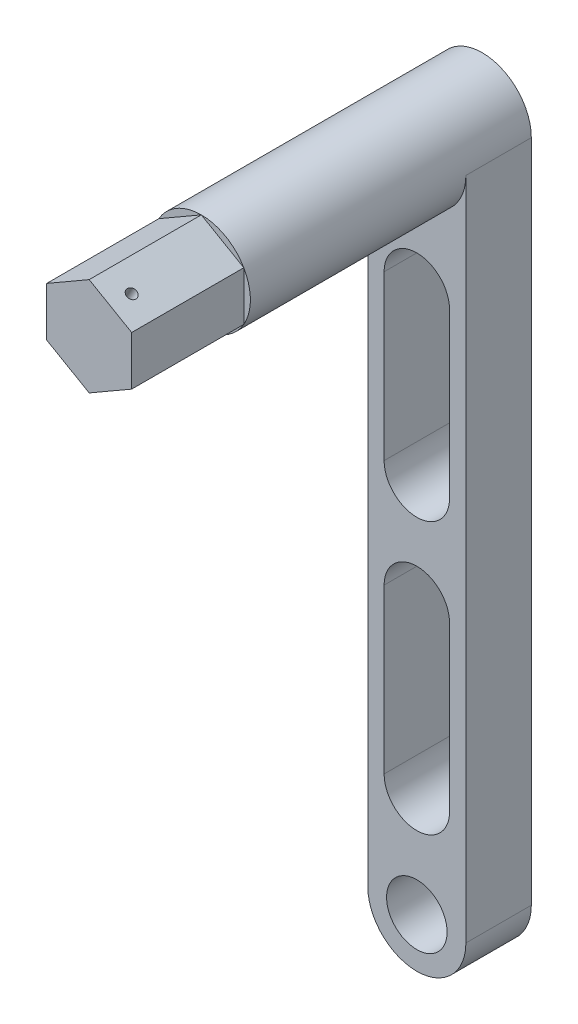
ISO-10303-21;
HEADER;
FILE_DESCRIPTION(('STEP AP214'),'2;1');
FILE_NAME('part.step','',(''),(''),'','','');
FILE_SCHEMA(('AUTOMOTIVE_DESIGN { 1 0 10303 214 1 1 1 1 }'));
ENDSEC;
DATA;
#1=APPLICATION_CONTEXT('core data for automotive mechanical design processes');
#2=APPLICATION_PROTOCOL_DEFINITION('international standard','automotive_design',2000,#1);
#3=PRODUCT_CONTEXT('',#1,'mechanical');
#4=PRODUCT('Part','Part','',(#3));
#5=PRODUCT_RELATED_PRODUCT_CATEGORY('part','',(#4));
#6=PRODUCT_DEFINITION_FORMATION('','',#4);
#7=PRODUCT_DEFINITION_CONTEXT('part definition',#1,'design');
#8=PRODUCT_DEFINITION('design','',#6,#7);
#9=PRODUCT_DEFINITION_SHAPE('','',#8);
#10=(LENGTH_UNIT() NAMED_UNIT(*) SI_UNIT(.MILLI.,.METRE.));
#11=(NAMED_UNIT(*) PLANE_ANGLE_UNIT() SI_UNIT($,.RADIAN.));
#12=(NAMED_UNIT(*) SI_UNIT($,.STERADIAN.) SOLID_ANGLE_UNIT());
#13=UNCERTAINTY_MEASURE_WITH_UNIT(LENGTH_MEASURE(1.E-05),#10,'distance_accuracy_value','');
#14=(GEOMETRIC_REPRESENTATION_CONTEXT(3) GLOBAL_UNCERTAINTY_ASSIGNED_CONTEXT((#13)) GLOBAL_UNIT_ASSIGNED_CONTEXT((#10,
#11,#12)) REPRESENTATION_CONTEXT('',''));
#15=CARTESIAN_POINT('',(0.,0.,0.));
#16=DIRECTION('',(0.,0.,1.));
#17=DIRECTION('',(1.,0.,0.));
#18=AXIS2_PLACEMENT_3D('',#15,#16,#17);
#19=CARTESIAN_POINT('',(0.,0.,42.94));
#20=DIRECTION('',(0.,0.,1.));
#21=DIRECTION('',(1.,0.,0.));
#22=AXIS2_PLACEMENT_3D('',#19,#20,#21);
#23=PLANE('',#22);
#24=DIRECTION('',(0.866025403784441,-0.499999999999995,0.));
#25=VECTOR('',#24,1.);
#26=CARTESIAN_POINT('',(-6.49519052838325,47.0499999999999,42.94));
#27=LINE('',#26,#25);
#28=CARTESIAN_POINT('',(-6.49519052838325,47.0499999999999,42.94));
#29=VERTEX_POINT('',#28);
#30=CARTESIAN_POINT('',(0.,43.3,42.94));
#31=VERTEX_POINT('',#30);
#32=EDGE_CURVE('E61',#29,#31,#27,.T.);
#33=ORIENTED_EDGE('',*,*,#32,.F.);
#34=CARTESIAN_POINT('',(0.,50.8,42.94));
#35=DIRECTION('',(0.,0.,1.));
#36=DIRECTION('',(1.,0.,0.));
#37=AXIS2_PLACEMENT_3D('',#34,#35,#36);
#38=CIRCLE('',#37,7.5);
#39=EDGE_CURVE('E424',#29,#31,#38,.T.);
#40=ORIENTED_EDGE('',*,*,#39,.T.);
#41=EDGE_LOOP('',(#33,#40));
#42=FACE_BOUND('',#41,.T.);
#43=ADVANCED_FACE('F38',(#42),#23,.T.);
#44=DIRECTION('',(0.,-1.,0.));
#45=VECTOR('',#44,1.);
#46=CARTESIAN_POINT('',(-6.49519052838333,54.5499999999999,42.94));
#47=LINE('',#46,#45);
#48=CARTESIAN_POINT('',(-6.49519052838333,54.5499999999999,42.94));
#49=VERTEX_POINT('',#48);
#50=EDGE_CURVE('E184',#49,#29,#47,.T.);
#51=ORIENTED_EDGE('',*,*,#50,.F.);
#52=EDGE_CURVE('E423',#49,#29,#38,.T.);
#53=ORIENTED_EDGE('',*,*,#52,.T.);
#54=EDGE_LOOP('',(#51,#53));
#55=FACE_BOUND('',#54,.T.);
#56=ADVANCED_FACE('F327',(#55),#23,.T.);
#57=DIRECTION('',(-0.866025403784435,-0.500000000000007,0.));
#58=VECTOR('',#57,1.);
#59=CARTESIAN_POINT('',(0.,58.3,42.94));
#60=LINE('',#59,#58);
#61=CARTESIAN_POINT('',(0.,58.3,42.94));
#62=VERTEX_POINT('',#61);
#63=EDGE_CURVE('E385',#62,#49,#60,.T.);
#64=ORIENTED_EDGE('',*,*,#63,.F.);
#65=EDGE_CURVE('E198',#62,#49,#38,.T.);
#66=ORIENTED_EDGE('',*,*,#65,.T.);
#67=EDGE_LOOP('',(#64,#66));
#68=FACE_BOUND('',#67,.T.);
#69=ADVANCED_FACE('F331',(#68),#23,.T.);
#70=DIRECTION('',(-0.866025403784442,0.499999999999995,0.));
#71=VECTOR('',#70,1.);
#72=CARTESIAN_POINT('',(6.49519052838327,54.55,42.94));
#73=LINE('',#72,#71);
#74=CARTESIAN_POINT('',(6.49519052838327,54.55,42.94));
#75=VERTEX_POINT('',#74);
#76=EDGE_CURVE('E382',#75,#62,#73,.T.);
#77=ORIENTED_EDGE('',*,*,#76,.F.);
#78=EDGE_CURVE('E195',#75,#62,#38,.T.);
#79=ORIENTED_EDGE('',*,*,#78,.T.);
#80=EDGE_LOOP('',(#77,#79));
#81=FACE_BOUND('',#80,.T.);
#82=ADVANCED_FACE('F410',(#81),#23,.T.);
#83=DIRECTION('',(0.,1.,0.));
#84=VECTOR('',#83,1.);
#85=CARTESIAN_POINT('',(6.4951905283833,47.05,42.94));
#86=LINE('',#85,#84);
#87=CARTESIAN_POINT('',(6.4951905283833,47.05,42.94));
#88=VERTEX_POINT('',#87);
#89=EDGE_CURVE('E379',#88,#75,#86,.T.);
#90=ORIENTED_EDGE('',*,*,#89,.F.);
#91=EDGE_CURVE('E189',#88,#75,#38,.T.);
#92=ORIENTED_EDGE('',*,*,#91,.T.);
#93=EDGE_LOOP('',(#90,#92));
#94=FACE_BOUND('',#93,.T.);
#95=ADVANCED_FACE('F322',(#94),#23,.T.);
#96=CARTESIAN_POINT('',(0.,-9.675,10.));
#97=DIRECTION('',(0.,0.,-1.));
#98=DIRECTION('',(-1.,0.,0.));
#99=AXIS2_PLACEMENT_3D('',#96,#97,#98);
#100=CYLINDRICAL_SURFACE('',#99,5.);
#101=CARTESIAN_POINT('',(0.,-9.675,0.));
#102=DIRECTION('',(0.,0.,1.));
#103=DIRECTION('',(1.,0.,0.));
#104=AXIS2_PLACEMENT_3D('',#101,#102,#103);
#105=CIRCLE('',#104,5.);
#106=CARTESIAN_POINT('',(5.,-9.67499999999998,0.));
#107=VERTEX_POINT('',#106);
#108=CARTESIAN_POINT('',(-5.00000000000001,-9.67499999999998,0.));
#109=VERTEX_POINT('',#108);
#110=EDGE_CURVE('E256',#107,#109,#105,.T.);
#111=ORIENTED_EDGE('',*,*,#110,.F.);
#112=DIRECTION('',(0.,0.,-1.));
#113=VECTOR('',#112,1.);
#114=CARTESIAN_POINT('',(5.,-9.67499999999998,10.));
#115=LINE('',#114,#113);
#116=CARTESIAN_POINT('',(5.,-9.67499999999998,10.));
#117=VERTEX_POINT('',#116);
#118=EDGE_CURVE('E11',#117,#107,#115,.T.);
#119=ORIENTED_EDGE('',*,*,#118,.F.);
#120=CARTESIAN_POINT('',(0.,-9.675,10.));
#121=DIRECTION('',(0.,0.,1.));
#122=DIRECTION('',(1.,0.,0.));
#123=AXIS2_PLACEMENT_3D('',#120,#121,#122);
#124=CIRCLE('',#123,5.);
#125=CARTESIAN_POINT('',(-5.00000000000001,-9.67499999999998,10.));
#126=VERTEX_POINT('',#125);
#127=EDGE_CURVE('E222',#117,#126,#124,.T.);
#128=ORIENTED_EDGE('',*,*,#127,.T.);
#129=DIRECTION('',(0.,0.,-1.));
#130=VECTOR('',#129,1.);
#131=CARTESIAN_POINT('',(-5.00000000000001,-9.67499999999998,10.));
#132=LINE('',#131,#130);
#133=EDGE_CURVE('E270',#126,#109,#132,.T.);
#134=ORIENTED_EDGE('',*,*,#133,.T.);
#135=EDGE_LOOP('',(#111,#119,#128,#134));
#136=FACE_BOUND('',#135,.T.);
#137=ADVANCED_FACE('F416',(#136),#100,.F.);
#138=CARTESIAN_POINT('',(5.,0.,10.));
#139=DIRECTION('',(-1.,0.,0.));
#140=DIRECTION('',(0.,-1.,0.));
#141=AXIS2_PLACEMENT_3D('',#138,#139,#140);
#142=PLANE('',#141);
#143=DIRECTION('',(0.,1.,0.));
#144=VECTOR('',#143,1.);
#145=CARTESIAN_POINT('',(5.,0.,0.));
#146=LINE('',#145,#144);
#147=CARTESIAN_POINT('',(5.,-34.675,0.));
#148=VERTEX_POINT('',#147);
#149=EDGE_CURVE('E259',#148,#107,#146,.T.);
#150=ORIENTED_EDGE('',*,*,#149,.F.);
#151=DIRECTION('',(0.,0.,-1.));
#152=VECTOR('',#151,1.);
#153=CARTESIAN_POINT('',(5.,-34.675,10.));
#154=LINE('',#153,#152);
#155=CARTESIAN_POINT('',(5.,-34.675,10.));
#156=VERTEX_POINT('',#155);
#157=EDGE_CURVE('E47',#156,#148,#154,.T.);
#158=ORIENTED_EDGE('',*,*,#157,.F.);
#159=DIRECTION('',(0.,1.,0.));
#160=VECTOR('',#159,1.);
#161=CARTESIAN_POINT('',(5.,0.,10.));
#162=LINE('',#161,#160);
#163=EDGE_CURVE('E225',#156,#117,#162,.T.);
#164=ORIENTED_EDGE('',*,*,#163,.T.);
#165=ORIENTED_EDGE('',*,*,#118,.T.);
#166=EDGE_LOOP('',(#150,#158,#164,#165));
#167=FACE_BOUND('',#166,.T.);
#168=ADVANCED_FACE('F542',(#167),#142,.T.);
#169=CARTESIAN_POINT('',(0.,-34.675,10.));
#170=DIRECTION('',(0.,0.,-1.));
#171=DIRECTION('',(-1.,0.,0.));
#172=AXIS2_PLACEMENT_3D('',#169,#170,#171);
#173=CYLINDRICAL_SURFACE('',#172,5.);
#174=CARTESIAN_POINT('',(0.,-34.675,0.));
#175=DIRECTION('',(0.,0.,1.));
#176=DIRECTION('',(1.,0.,0.));
#177=AXIS2_PLACEMENT_3D('',#174,#175,#176);
#178=CIRCLE('',#177,5.);
#179=CARTESIAN_POINT('',(-5.,-34.675,0.));
#180=VERTEX_POINT('',#179);
#181=EDGE_CURVE('E262',#180,#148,#178,.T.);
#182=ORIENTED_EDGE('',*,*,#181,.F.);
#183=DIRECTION('',(0.,0.,-1.));
#184=VECTOR('',#183,1.);
#185=CARTESIAN_POINT('',(-5.,-34.675,10.));
#186=LINE('',#185,#184);
#187=CARTESIAN_POINT('',(-5.,-34.675,10.));
#188=VERTEX_POINT('',#187);
#189=EDGE_CURVE('E272',#188,#180,#186,.T.);
#190=ORIENTED_EDGE('',*,*,#189,.F.);
#191=CARTESIAN_POINT('',(0.,-34.675,10.));
#192=DIRECTION('',(0.,0.,1.));
#193=DIRECTION('',(1.,0.,0.));
#194=AXIS2_PLACEMENT_3D('',#191,#192,#193);
#195=CIRCLE('',#194,5.);
#196=EDGE_CURVE('E228',#188,#156,#195,.T.);
#197=ORIENTED_EDGE('',*,*,#196,.T.);
#198=ORIENTED_EDGE('',*,*,#157,.T.);
#199=EDGE_LOOP('',(#182,#190,#197,#198));
#200=FACE_BOUND('',#199,.T.);
#201=ADVANCED_FACE('F532',(#200),#173,.F.);
#202=CARTESIAN_POINT('',(0.,6.80000000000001,10.));
#203=DIRECTION('',(0.,0.,-1.));
#204=DIRECTION('',(-1.,0.,0.));
#205=AXIS2_PLACEMENT_3D('',#202,#203,#204);
#206=CYLINDRICAL_SURFACE('',#205,5.);
#207=CARTESIAN_POINT('',(0.,6.80000000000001,0.));
#208=DIRECTION('',(0.,0.,1.));
#209=DIRECTION('',(1.,0.,0.));
#210=AXIS2_PLACEMENT_3D('',#207,#208,#209);
#211=CIRCLE('',#210,5.);
#212=CARTESIAN_POINT('',(-5.,6.80000000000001,0.));
#213=VERTEX_POINT('',#212);
#214=CARTESIAN_POINT('',(5.,6.80000000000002,0.));
#215=VERTEX_POINT('',#214);
#216=EDGE_CURVE('E244',#213,#215,#211,.T.);
#217=ORIENTED_EDGE('',*,*,#216,.F.);
#218=DIRECTION('',(0.,0.,-1.));
#219=VECTOR('',#218,1.);
#220=CARTESIAN_POINT('',(-5.,6.80000000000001,10.));
#221=LINE('',#220,#219);
#222=CARTESIAN_POINT('',(-5.,6.80000000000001,10.));
#223=VERTEX_POINT('',#222);
#224=EDGE_CURVE('E273',#223,#213,#221,.T.);
#225=ORIENTED_EDGE('',*,*,#224,.F.);
#226=CARTESIAN_POINT('',(0.,6.80000000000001,10.));
#227=DIRECTION('',(0.,0.,1.));
#228=DIRECTION('',(1.,0.,0.));
#229=AXIS2_PLACEMENT_3D('',#226,#227,#228);
#230=CIRCLE('',#229,5.);
#231=CARTESIAN_POINT('',(5.,6.80000000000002,10.));
#232=VERTEX_POINT('',#231);
#233=EDGE_CURVE('E211',#223,#232,#230,.T.);
#234=ORIENTED_EDGE('',*,*,#233,.T.);
#235=DIRECTION('',(0.,0.,-1.));
#236=VECTOR('',#235,1.);
#237=CARTESIAN_POINT('',(5.,6.80000000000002,10.));
#238=LINE('',#237,#236);
#239=EDGE_CURVE('E276',#232,#215,#238,.T.);
#240=ORIENTED_EDGE('',*,*,#239,.T.);
#241=EDGE_LOOP('',(#217,#225,#234,#240));
#242=FACE_BOUND('',#241,.T.);
#243=ADVANCED_FACE('F522',(#242),#206,.F.);
#244=CARTESIAN_POINT('',(-5.,0.,10.));
#245=DIRECTION('',(1.,0.,0.));
#246=DIRECTION('',(0.,0.,-1.));
#247=AXIS2_PLACEMENT_3D('',#244,#245,#246);
#248=PLANE('',#247);
#249=DIRECTION('',(0.,-1.,0.));
#250=VECTOR('',#249,1.);
#251=CARTESIAN_POINT('',(-5.,0.,0.));
#252=LINE('',#251,#250);
#253=CARTESIAN_POINT('',(-5.,31.8,0.));
#254=VERTEX_POINT('',#253);
#255=EDGE_CURVE('E247',#254,#213,#252,.T.);
#256=ORIENTED_EDGE('',*,*,#255,.F.);
#257=DIRECTION('',(0.,0.,-1.));
#258=VECTOR('',#257,1.);
#259=CARTESIAN_POINT('',(-5.,31.8,10.));
#260=LINE('',#259,#258);
#261=CARTESIAN_POINT('',(-5.,31.8,10.));
#262=VERTEX_POINT('',#261);
#263=EDGE_CURVE('E281',#262,#254,#260,.T.);
#264=ORIENTED_EDGE('',*,*,#263,.F.);
#265=DIRECTION('',(0.,-1.,0.));
#266=VECTOR('',#265,1.);
#267=CARTESIAN_POINT('',(-5.,0.,10.));
#268=LINE('',#267,#266);
#269=EDGE_CURVE('E214',#262,#223,#268,.T.);
#270=ORIENTED_EDGE('',*,*,#269,.T.);
#271=ORIENTED_EDGE('',*,*,#224,.T.);
#272=EDGE_LOOP('',(#256,#264,#270,#271));
#273=FACE_BOUND('',#272,.T.);
#274=ADVANCED_FACE('F512',(#273),#248,.T.);
#275=CARTESIAN_POINT('',(0.,31.8,10.));
#276=DIRECTION('',(0.,0.,-1.));
#277=DIRECTION('',(-1.,0.,0.));
#278=AXIS2_PLACEMENT_3D('',#275,#276,#277);
#279=CYLINDRICAL_SURFACE('',#278,5.);
#280=CARTESIAN_POINT('',(0.,31.8,0.));
#281=DIRECTION('',(0.,0.,1.));
#282=DIRECTION('',(1.,0.,0.));
#283=AXIS2_PLACEMENT_3D('',#280,#281,#282);
#284=CIRCLE('',#283,5.);
#285=CARTESIAN_POINT('',(5.,31.8,0.));
#286=VERTEX_POINT('',#285);
#287=EDGE_CURVE('E250',#286,#254,#284,.T.);
#288=ORIENTED_EDGE('',*,*,#287,.F.);
#289=DIRECTION('',(0.,0.,-1.));
#290=VECTOR('',#289,1.);
#291=CARTESIAN_POINT('',(5.,31.8,10.));
#292=LINE('',#291,#290);
#293=CARTESIAN_POINT('',(5.,31.8,10.));
#294=VERTEX_POINT('',#293);
#295=EDGE_CURVE('E278',#294,#286,#292,.T.);
#296=ORIENTED_EDGE('',*,*,#295,.F.);
#297=CARTESIAN_POINT('',(0.,31.8,10.));
#298=DIRECTION('',(0.,0.,1.));
#299=DIRECTION('',(1.,0.,0.));
#300=AXIS2_PLACEMENT_3D('',#297,#298,#299);
#301=CIRCLE('',#300,5.);
#302=EDGE_CURVE('E217',#294,#262,#301,.T.);
#303=ORIENTED_EDGE('',*,*,#302,.T.);
#304=ORIENTED_EDGE('',*,*,#263,.T.);
#305=EDGE_LOOP('',(#288,#296,#303,#304));
#306=FACE_BOUND('',#305,.T.);
#307=ADVANCED_FACE('F473',(#306),#279,.F.);
#308=CARTESIAN_POINT('',(-7.50000000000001,0.,10.));
#309=DIRECTION('',(-1.,0.,0.));
#310=DIRECTION('',(0.,-1.,0.));
#311=AXIS2_PLACEMENT_3D('',#308,#309,#310);
#312=PLANE('',#311);
#313=DIRECTION('',(0.,1.,0.));
#314=VECTOR('',#313,1.);
#315=CARTESIAN_POINT('',(-7.50000000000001,0.,0.));
#316=LINE('',#315,#314);
#317=CARTESIAN_POINT('',(-7.5,-50.8,0.));
#318=VERTEX_POINT('',#317);
#319=CARTESIAN_POINT('',(-7.5,50.8,0.));
#320=VERTEX_POINT('',#319);
#321=EDGE_CURVE('E197',#318,#320,#316,.T.);
#322=ORIENTED_EDGE('',*,*,#321,.F.);
#323=DIRECTION('',(0.,0.,-1.));
#324=VECTOR('',#323,1.);
#325=CARTESIAN_POINT('',(-7.5,-50.8,10.));
#326=LINE('',#325,#324);
#327=CARTESIAN_POINT('',(-7.5,-50.8,10.));
#328=VERTEX_POINT('',#327);
#329=EDGE_CURVE('E289',#328,#318,#326,.T.);
#330=ORIENTED_EDGE('',*,*,#329,.F.);
#331=DIRECTION('',(0.,1.,0.));
#332=VECTOR('',#331,1.);
#333=CARTESIAN_POINT('',(-7.50000000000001,0.,10.));
#334=LINE('',#333,#332);
#335=CARTESIAN_POINT('',(-7.5,50.8,10.));
#336=VERTEX_POINT('',#335);
#337=EDGE_CURVE('E202',#328,#336,#334,.T.);
#338=ORIENTED_EDGE('',*,*,#337,.T.);
#339=DIRECTION('',(0.,0.,-1.));
#340=VECTOR('',#339,1.);
#341=CARTESIAN_POINT('',(-7.50000000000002,50.8,10.));
#342=LINE('',#341,#340);
#343=EDGE_CURVE('E279',#336,#320,#342,.T.);
#344=ORIENTED_EDGE('',*,*,#343,.T.);
#345=EDGE_LOOP('',(#322,#330,#338,#344));
#346=FACE_BOUND('',#345,.T.);
#347=ADVANCED_FACE('F40',(#346),#312,.T.);
#348=CARTESIAN_POINT('',(0.,-50.8,10.));
#349=DIRECTION('',(0.,0.,-1.));
#350=DIRECTION('',(-1.,0.,0.));
#351=AXIS2_PLACEMENT_3D('',#348,#349,#350);
#352=CYLINDRICAL_SURFACE('',#351,7.5);
#353=CARTESIAN_POINT('',(0.,-50.8,0.));
#354=DIRECTION('',(0.,0.,1.));
#355=DIRECTION('',(1.,0.,0.));
#356=AXIS2_PLACEMENT_3D('',#353,#354,#355);
#357=CIRCLE('',#356,7.5);
#358=CARTESIAN_POINT('',(7.5,-50.8,0.));
#359=VERTEX_POINT('',#358);
#360=EDGE_CURVE('E239',#318,#359,#357,.T.);
#361=ORIENTED_EDGE('',*,*,#360,.T.);
#362=DIRECTION('',(0.,0.,-1.));
#363=VECTOR('',#362,1.);
#364=CARTESIAN_POINT('',(7.5,-50.8,10.));
#365=LINE('',#364,#363);
#366=CARTESIAN_POINT('',(7.5,-50.8,10.));
#367=VERTEX_POINT('',#366);
#368=EDGE_CURVE('E286',#367,#359,#365,.T.);
#369=ORIENTED_EDGE('',*,*,#368,.F.);
#370=CARTESIAN_POINT('',(0.,-50.8,10.));
#371=DIRECTION('',(0.,0.,1.));
#372=DIRECTION('',(1.,0.,0.));
#373=AXIS2_PLACEMENT_3D('',#370,#371,#372);
#374=CIRCLE('',#373,7.5);
#375=EDGE_CURVE('E206',#328,#367,#374,.T.);
#376=ORIENTED_EDGE('',*,*,#375,.F.);
#377=ORIENTED_EDGE('',*,*,#329,.T.);
#378=EDGE_LOOP('',(#361,#369,#376,#377));
#379=FACE_BOUND('',#378,.T.);
#380=ADVANCED_FACE('F303',(#379),#352,.T.);
#381=CARTESIAN_POINT('',(-5.00000000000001,0.,10.));
#382=DIRECTION('',(-1.,0.,0.));
#383=DIRECTION('',(0.,-1.,0.));
#384=AXIS2_PLACEMENT_3D('',#381,#382,#383);
#385=PLANE('',#384);
#386=DIRECTION('',(0.,1.,0.));
#387=VECTOR('',#386,1.);
#388=CARTESIAN_POINT('',(-5.00000000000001,0.,0.));
#389=LINE('',#388,#387);
#390=EDGE_CURVE('E265',#180,#109,#389,.T.);
#391=ORIENTED_EDGE('',*,*,#390,.T.);
#392=ORIENTED_EDGE('',*,*,#133,.F.);
#393=DIRECTION('',(0.,1.,0.));
#394=VECTOR('',#393,1.);
#395=CARTESIAN_POINT('',(-5.00000000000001,0.,10.));
#396=LINE('',#395,#394);
#397=EDGE_CURVE('E231',#188,#126,#396,.T.);
#398=ORIENTED_EDGE('',*,*,#397,.F.);
#399=ORIENTED_EDGE('',*,*,#189,.T.);
#400=EDGE_LOOP('',(#391,#392,#398,#399));
#401=FACE_BOUND('',#400,.T.);
#402=ADVANCED_FACE('F488',(#401),#385,.F.);
#403=CARTESIAN_POINT('',(5.,0.,10.));
#404=DIRECTION('',(1.,0.,0.));
#405=DIRECTION('',(0.,0.,-1.));
#406=AXIS2_PLACEMENT_3D('',#403,#404,#405);
#407=PLANE('',#406);
#408=DIRECTION('',(0.,-1.,0.));
#409=VECTOR('',#408,1.);
#410=CARTESIAN_POINT('',(5.,0.,0.));
#411=LINE('',#410,#409);
#412=EDGE_CURVE('E253',#286,#215,#411,.T.);
#413=ORIENTED_EDGE('',*,*,#412,.T.);
#414=ORIENTED_EDGE('',*,*,#239,.F.);
#415=DIRECTION('',(0.,-1.,0.));
#416=VECTOR('',#415,1.);
#417=CARTESIAN_POINT('',(5.,0.,10.));
#418=LINE('',#417,#416);
#419=EDGE_CURVE('E220',#294,#232,#418,.T.);
#420=ORIENTED_EDGE('',*,*,#419,.F.);
#421=ORIENTED_EDGE('',*,*,#295,.T.);
#422=EDGE_LOOP('',(#413,#414,#420,#421));
#423=FACE_BOUND('',#422,.T.);
#424=ADVANCED_FACE('F461',(#423),#407,.F.);
#425=CARTESIAN_POINT('',(7.49999999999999,0.,10.));
#426=DIRECTION('',(-1.,0.,0.));
#427=DIRECTION('',(0.,-1.,0.));
#428=AXIS2_PLACEMENT_3D('',#425,#426,#427);
#429=PLANE('',#428);
#430=DIRECTION('',(0.,1.,0.));
#431=VECTOR('',#430,1.);
#432=CARTESIAN_POINT('',(7.49999999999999,0.,0.));
#433=LINE('',#432,#431);
#434=CARTESIAN_POINT('',(7.49999999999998,50.8,0.));
#435=VERTEX_POINT('',#434);
#436=EDGE_CURVE('E241',#359,#435,#433,.T.);
#437=ORIENTED_EDGE('',*,*,#436,.T.);
#438=DIRECTION('',(0.,0.,-1.));
#439=VECTOR('',#438,1.);
#440=CARTESIAN_POINT('',(7.49999999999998,50.8,10.));
#441=LINE('',#440,#439);
#442=CARTESIAN_POINT('',(7.5,50.8,10.));
#443=VERTEX_POINT('',#442);
#444=EDGE_CURVE('E236',#443,#435,#441,.T.);
#445=ORIENTED_EDGE('',*,*,#444,.F.);
#446=DIRECTION('',(0.,1.,0.));
#447=VECTOR('',#446,1.);
#448=CARTESIAN_POINT('',(7.49999999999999,0.,10.));
#449=LINE('',#448,#447);
#450=EDGE_CURVE('E208',#367,#443,#449,.T.);
#451=ORIENTED_EDGE('',*,*,#450,.F.);
#452=ORIENTED_EDGE('',*,*,#368,.T.);
#453=EDGE_LOOP('',(#437,#445,#451,#452));
#454=FACE_BOUND('',#453,.T.);
#455=ADVANCED_FACE('F307',(#454),#429,.F.);
#456=CARTESIAN_POINT('',(0.,-50.8,10.));
#457=DIRECTION('',(0.,0.,-1.));
#458=DIRECTION('',(-1.,0.,0.));
#459=AXIS2_PLACEMENT_3D('',#456,#457,#458);
#460=CYLINDRICAL_SURFACE('',#459,4.625);
#461=CARTESIAN_POINT('',(0.,-50.8,10.));
#462=DIRECTION('',(0.,0.,1.));
#463=DIRECTION('',(1.,0.,0.));
#464=AXIS2_PLACEMENT_3D('',#461,#462,#463);
#465=CIRCLE('',#464,4.625);
#466=CARTESIAN_POINT('',(4.62500000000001,-50.8,10.));
#467=VERTEX_POINT('',#466);
#468=EDGE_CURVE('E233',#467,#467,#465,.T.);
#469=ORIENTED_EDGE('',*,*,#468,.T.);
#470=EDGE_LOOP('',(#469));
#471=FACE_BOUND('',#470,.T.);
#472=CARTESIAN_POINT('',(0.,-50.8,0.));
#473=DIRECTION('',(0.,0.,1.));
#474=DIRECTION('',(1.,0.,0.));
#475=AXIS2_PLACEMENT_3D('',#472,#473,#474);
#476=CIRCLE('',#475,4.625);
#477=CARTESIAN_POINT('',(4.62500000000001,-50.8,0.));
#478=VERTEX_POINT('',#477);
#479=EDGE_CURVE('E203',#478,#478,#476,.T.);
#480=ORIENTED_EDGE('',*,*,#479,.F.);
#481=EDGE_LOOP('',(#480));
#482=FACE_BOUND('',#481,.T.);
#483=ADVANCED_FACE('F451',(#471,#482),#460,.F.);
#484=CARTESIAN_POINT('',(0.,0.,10.));
#485=DIRECTION('',(0.,0.,1.));
#486=DIRECTION('',(1.,0.,0.));
#487=AXIS2_PLACEMENT_3D('',#484,#485,#486);
#488=PLANE('',#487);
#489=CARTESIAN_POINT('',(0.,50.8,10.));
#490=DIRECTION('',(0.,0.,1.));
#491=DIRECTION('',(1.,0.,0.));
#492=AXIS2_PLACEMENT_3D('',#489,#490,#491);
#493=CIRCLE('',#492,7.49999999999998);
#494=EDGE_CURVE('E200',#336,#443,#493,.T.);
#495=ORIENTED_EDGE('',*,*,#494,.F.);
#496=ORIENTED_EDGE('',*,*,#337,.F.);
#497=ORIENTED_EDGE('',*,*,#375,.T.);
#498=ORIENTED_EDGE('',*,*,#450,.T.);
#499=EDGE_LOOP('',(#495,#496,#497,#498));
#500=FACE_BOUND('',#499,.T.);
#501=ORIENTED_EDGE('',*,*,#233,.F.);
#502=ORIENTED_EDGE('',*,*,#269,.F.);
#503=ORIENTED_EDGE('',*,*,#302,.F.);
#504=ORIENTED_EDGE('',*,*,#419,.T.);
#505=EDGE_LOOP('',(#501,#502,#503,#504));
#506=FACE_BOUND('',#505,.T.);
#507=ORIENTED_EDGE('',*,*,#127,.F.);
#508=ORIENTED_EDGE('',*,*,#163,.F.);
#509=ORIENTED_EDGE('',*,*,#196,.F.);
#510=ORIENTED_EDGE('',*,*,#397,.T.);
#511=EDGE_LOOP('',(#507,#508,#509,#510));
#512=FACE_BOUND('',#511,.T.);
#513=ORIENTED_EDGE('',*,*,#468,.F.);
#514=EDGE_LOOP('',(#513));
#515=FACE_BOUND('',#514,.T.);
#516=ADVANCED_FACE('F310',(#500,#506,#512,#515),#488,.T.);
#517=CARTESIAN_POINT('',(0.,0.,0.));
#518=DIRECTION('',(0.,0.,1.));
#519=DIRECTION('',(1.,0.,0.));
#520=AXIS2_PLACEMENT_3D('',#517,#518,#519);
#521=PLANE('',#520);
#522=ORIENTED_EDGE('',*,*,#321,.T.);
#523=CARTESIAN_POINT('',(0.,50.8,0.));
#524=DIRECTION('',(0.,0.,1.));
#525=DIRECTION('',(1.,0.,0.));
#526=AXIS2_PLACEMENT_3D('',#523,#524,#525);
#527=CIRCLE('',#526,7.5);
#528=EDGE_CURVE('E187',#435,#320,#527,.T.);
#529=ORIENTED_EDGE('',*,*,#528,.F.);
#530=ORIENTED_EDGE('',*,*,#436,.F.);
#531=ORIENTED_EDGE('',*,*,#360,.F.);
#532=EDGE_LOOP('',(#522,#529,#530,#531));
#533=FACE_BOUND('',#532,.T.);
#534=ORIENTED_EDGE('',*,*,#216,.T.);
#535=ORIENTED_EDGE('',*,*,#412,.F.);
#536=ORIENTED_EDGE('',*,*,#287,.T.);
#537=ORIENTED_EDGE('',*,*,#255,.T.);
#538=EDGE_LOOP('',(#534,#535,#536,#537));
#539=FACE_BOUND('',#538,.T.);
#540=ORIENTED_EDGE('',*,*,#110,.T.);
#541=ORIENTED_EDGE('',*,*,#390,.F.);
#542=ORIENTED_EDGE('',*,*,#181,.T.);
#543=ORIENTED_EDGE('',*,*,#149,.T.);
#544=EDGE_LOOP('',(#540,#541,#542,#543));
#545=FACE_BOUND('',#544,.T.);
#546=ORIENTED_EDGE('',*,*,#479,.T.);
#547=EDGE_LOOP('',(#546));
#548=FACE_BOUND('',#547,.T.);
#549=ADVANCED_FACE('F298',(#533,#539,#545,#548),#521,.F.);
#550=CARTESIAN_POINT('',(0.,50.8,42.94));
#551=DIRECTION('',(0.,0.,-1.));
#552=DIRECTION('',(-1.,0.,0.));
#553=AXIS2_PLACEMENT_3D('',#550,#551,#552);
#554=CYLINDRICAL_SURFACE('',#553,7.5);
#555=ORIENTED_EDGE('',*,*,#78,.F.);
#556=ORIENTED_EDGE('',*,*,#91,.F.);
#557=EDGE_CURVE('E405',#31,#88,#38,.T.);
#558=ORIENTED_EDGE('',*,*,#557,.F.);
#559=ORIENTED_EDGE('',*,*,#39,.F.);
#560=ORIENTED_EDGE('',*,*,#52,.F.);
#561=ORIENTED_EDGE('',*,*,#65,.F.);
#562=EDGE_LOOP('',(#555,#556,#558,#559,#560,#561));
#563=FACE_BOUND('',#562,.T.);
#564=ORIENTED_EDGE('',*,*,#528,.T.);
#565=ORIENTED_EDGE('',*,*,#343,.F.);
#566=ORIENTED_EDGE('',*,*,#494,.T.);
#567=ORIENTED_EDGE('',*,*,#444,.T.);
#568=EDGE_LOOP('',(#564,#565,#566,#567));
#569=FACE_BOUND('',#568,.T.);
#570=ADVANCED_FACE('F312',(#563,#569),#554,.T.);
#571=DIRECTION('',(0.866025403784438,0.500000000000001,0.));
#572=VECTOR('',#571,1.);
#573=CARTESIAN_POINT('',(0.,43.3,42.94));
#574=LINE('',#573,#572);
#575=EDGE_CURVE('E54',#31,#88,#574,.T.);
#576=ORIENTED_EDGE('',*,*,#575,.F.);
#577=ORIENTED_EDGE('',*,*,#557,.T.);
#578=EDGE_LOOP('',(#576,#577));
#579=FACE_BOUND('',#578,.T.);
#580=ADVANCED_FACE('F314',(#579),#23,.T.);
#581=CARTESIAN_POINT('',(-6.49519052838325,47.0499999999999,60.08));
#582=DIRECTION('',(0.499999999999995,0.866025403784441,0.));
#583=DIRECTION('',(-0.866025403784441,0.499999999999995,0.));
#584=AXIS2_PLACEMENT_3D('',#581,#582,#583);
#585=PLANE('',#584);
#586=CARTESIAN_POINT('',(-3.24759526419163,45.1749999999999,56.83));
#587=DIRECTION('',(0.499999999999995,0.866025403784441,0.));
#588=DIRECTION('',(-0.866025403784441,0.499999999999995,0.));
#589=AXIS2_PLACEMENT_3D('',#586,#587,#588);
#590=CIRCLE('',#589,0.750000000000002);
#591=CARTESIAN_POINT('',(-3.89711431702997,45.5499999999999,56.83));
#592=VERTEX_POINT('',#591);
#593=EDGE_CURVE('E367',#592,#592,#590,.T.);
#594=ORIENTED_EDGE('',*,*,#593,.T.);
#595=EDGE_LOOP('',(#594));
#596=FACE_BOUND('',#595,.T.);
#597=ORIENTED_EDGE('',*,*,#32,.T.);
#598=DIRECTION('',(0.,0.,-1.));
#599=VECTOR('',#598,1.);
#600=CARTESIAN_POINT('',(0.,43.3,60.08));
#601=LINE('',#600,#599);
#602=CARTESIAN_POINT('',(0.,43.3,60.08));
#603=VERTEX_POINT('',#602);
#604=EDGE_CURVE('E169',#603,#31,#601,.T.);
#605=ORIENTED_EDGE('',*,*,#604,.F.);
#606=DIRECTION('',(0.866025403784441,-0.499999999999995,0.));
#607=VECTOR('',#606,1.);
#608=CARTESIAN_POINT('',(-6.49519052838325,47.0499999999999,60.08));
#609=LINE('',#608,#607);
#610=CARTESIAN_POINT('',(-6.49519052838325,47.0499999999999,60.08));
#611=VERTEX_POINT('',#610);
#612=EDGE_CURVE('E175',#611,#603,#609,.T.);
#613=ORIENTED_EDGE('',*,*,#612,.F.);
#614=DIRECTION('',(0.,0.,-1.));
#615=VECTOR('',#614,1.);
#616=CARTESIAN_POINT('',(-6.49519052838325,47.0499999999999,60.08));
#617=LINE('',#616,#615);
#618=EDGE_CURVE('E376',#611,#29,#617,.T.);
#619=ORIENTED_EDGE('',*,*,#618,.T.);
#620=EDGE_LOOP('',(#597,#605,#613,#619));
#621=FACE_BOUND('',#620,.T.);
#622=ADVANCED_FACE('F186',(#596,#621),#585,.F.);
#623=CARTESIAN_POINT('',(0.,43.3,60.08));
#624=DIRECTION('',(-0.500000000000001,0.866025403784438,0.));
#625=DIRECTION('',(-0.866025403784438,-0.500000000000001,0.));
#626=AXIS2_PLACEMENT_3D('',#623,#624,#625);
#627=PLANE('',#626);
#628=ORIENTED_EDGE('',*,*,#575,.T.);
#629=DIRECTION('',(0.,0.,-1.));
#630=VECTOR('',#629,1.);
#631=CARTESIAN_POINT('',(6.4951905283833,47.05,60.08));
#632=LINE('',#631,#630);
#633=CARTESIAN_POINT('',(6.4951905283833,47.05,60.08));
#634=VERTEX_POINT('',#633);
#635=EDGE_CURVE('E171',#634,#88,#632,.T.);
#636=ORIENTED_EDGE('',*,*,#635,.F.);
#637=DIRECTION('',(0.866025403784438,0.500000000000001,0.));
#638=VECTOR('',#637,1.);
#639=CARTESIAN_POINT('',(0.,43.3,60.08));
#640=LINE('',#639,#638);
#641=EDGE_CURVE('E165',#603,#634,#640,.T.);
#642=ORIENTED_EDGE('',*,*,#641,.F.);
#643=ORIENTED_EDGE('',*,*,#604,.T.);
#644=EDGE_LOOP('',(#628,#636,#642,#643));
#645=FACE_BOUND('',#644,.T.);
#646=ADVANCED_FACE('F167',(#645),#627,.F.);
#647=CARTESIAN_POINT('',(6.4951905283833,47.05,60.08));
#648=DIRECTION('',(-1.,0.,0.));
#649=DIRECTION('',(0.,-1.,0.));
#650=AXIS2_PLACEMENT_3D('',#647,#648,#649);
#651=PLANE('',#650);
#652=ORIENTED_EDGE('',*,*,#89,.T.);
#653=DIRECTION('',(0.,0.,-1.));
#654=VECTOR('',#653,1.);
#655=CARTESIAN_POINT('',(6.49519052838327,54.55,60.08));
#656=LINE('',#655,#654);
#657=CARTESIAN_POINT('',(6.49519052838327,54.55,60.08));
#658=VERTEX_POINT('',#657);
#659=EDGE_CURVE('E191',#658,#75,#656,.T.);
#660=ORIENTED_EDGE('',*,*,#659,.F.);
#661=DIRECTION('',(0.,1.,0.));
#662=VECTOR('',#661,1.);
#663=CARTESIAN_POINT('',(6.4951905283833,47.05,60.08));
#664=LINE('',#663,#662);
#665=EDGE_CURVE('E174',#634,#658,#664,.T.);
#666=ORIENTED_EDGE('',*,*,#665,.F.);
#667=ORIENTED_EDGE('',*,*,#635,.T.);
#668=EDGE_LOOP('',(#652,#660,#666,#667));
#669=FACE_BOUND('',#668,.T.);
#670=ADVANCED_FACE('F339',(#669),#651,.F.);
#671=CARTESIAN_POINT('',(6.49519052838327,54.55,60.08));
#672=DIRECTION('',(-0.499999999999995,-0.866025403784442,0.));
#673=DIRECTION('',(0.866025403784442,-0.499999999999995,0.));
#674=AXIS2_PLACEMENT_3D('',#671,#672,#673);
#675=PLANE('',#674);
#676=CARTESIAN_POINT('',(3.24759526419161,56.425,56.83));
#677=DIRECTION('',(-0.499999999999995,-0.866025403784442,0.));
#678=DIRECTION('',(0.866025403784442,-0.499999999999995,0.));
#679=AXIS2_PLACEMENT_3D('',#676,#677,#678);
#680=CIRCLE('',#679,0.750000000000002);
#681=CARTESIAN_POINT('',(3.89711431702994,56.05,56.83));
#682=VERTEX_POINT('',#681);
#683=EDGE_CURVE('E42',#682,#682,#680,.T.);
#684=ORIENTED_EDGE('',*,*,#683,.T.);
#685=EDGE_LOOP('',(#684));
#686=FACE_BOUND('',#685,.T.);
#687=ORIENTED_EDGE('',*,*,#76,.T.);
#688=DIRECTION('',(0.,0.,-1.));
#689=VECTOR('',#688,1.);
#690=CARTESIAN_POINT('',(0.,58.3,60.08));
#691=LINE('',#690,#689);
#692=CARTESIAN_POINT('',(0.,58.3,60.08));
#693=VERTEX_POINT('',#692);
#694=EDGE_CURVE('E394',#693,#62,#691,.T.);
#695=ORIENTED_EDGE('',*,*,#694,.F.);
#696=DIRECTION('',(-0.866025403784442,0.499999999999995,0.));
#697=VECTOR('',#696,1.);
#698=CARTESIAN_POINT('',(6.49519052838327,54.55,60.08));
#699=LINE('',#698,#697);
#700=EDGE_CURVE('E372',#658,#693,#699,.T.);
#701=ORIENTED_EDGE('',*,*,#700,.F.);
#702=ORIENTED_EDGE('',*,*,#659,.T.);
#703=EDGE_LOOP('',(#687,#695,#701,#702));
#704=FACE_BOUND('',#703,.T.);
#705=ADVANCED_FACE('F342',(#686,#704),#675,.F.);
#706=CARTESIAN_POINT('',(0.,58.3,60.08));
#707=DIRECTION('',(0.500000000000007,-0.866025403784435,0.));
#708=DIRECTION('',(0.866025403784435,0.500000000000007,0.));
#709=AXIS2_PLACEMENT_3D('',#706,#707,#708);
#710=PLANE('',#709);
#711=ORIENTED_EDGE('',*,*,#63,.T.);
#712=DIRECTION('',(0.,0.,-1.));
#713=VECTOR('',#712,1.);
#714=CARTESIAN_POINT('',(-6.49519052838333,54.5499999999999,60.08));
#715=LINE('',#714,#713);
#716=CARTESIAN_POINT('',(-6.49519052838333,54.5499999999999,60.08));
#717=VERTEX_POINT('',#716);
#718=EDGE_CURVE('E391',#717,#49,#715,.T.);
#719=ORIENTED_EDGE('',*,*,#718,.F.);
#720=DIRECTION('',(-0.866025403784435,-0.500000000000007,0.));
#721=VECTOR('',#720,1.);
#722=CARTESIAN_POINT('',(0.,58.3,60.08));
#723=LINE('',#722,#721);
#724=EDGE_CURVE('E374',#693,#717,#723,.T.);
#725=ORIENTED_EDGE('',*,*,#724,.F.);
#726=ORIENTED_EDGE('',*,*,#694,.T.);
#727=EDGE_LOOP('',(#711,#719,#725,#726));
#728=FACE_BOUND('',#727,.T.);
#729=ADVANCED_FACE('F346',(#728),#710,.F.);
#730=CARTESIAN_POINT('',(-6.49519052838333,54.5499999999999,60.08));
#731=DIRECTION('',(1.,0.,0.));
#732=DIRECTION('',(0.,1.,0.));
#733=AXIS2_PLACEMENT_3D('',#730,#731,#732);
#734=PLANE('',#733);
#735=ORIENTED_EDGE('',*,*,#50,.T.);
#736=ORIENTED_EDGE('',*,*,#618,.F.);
#737=DIRECTION('',(0.,-1.,0.));
#738=VECTOR('',#737,1.);
#739=CARTESIAN_POINT('',(-6.49519052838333,54.5499999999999,60.08));
#740=LINE('',#739,#738);
#741=EDGE_CURVE('E180',#717,#611,#740,.T.);
#742=ORIENTED_EDGE('',*,*,#741,.F.);
#743=ORIENTED_EDGE('',*,*,#718,.T.);
#744=EDGE_LOOP('',(#735,#736,#742,#743));
#745=FACE_BOUND('',#744,.T.);
#746=ADVANCED_FACE('F350',(#745),#734,.F.);
#747=CARTESIAN_POINT('',(0.,0.,60.08));
#748=DIRECTION('',(0.,0.,1.));
#749=DIRECTION('',(1.,0.,0.));
#750=AXIS2_PLACEMENT_3D('',#747,#748,#749);
#751=PLANE('',#750);
#752=ORIENTED_EDGE('',*,*,#612,.T.);
#753=ORIENTED_EDGE('',*,*,#641,.T.);
#754=ORIENTED_EDGE('',*,*,#665,.T.);
#755=ORIENTED_EDGE('',*,*,#700,.T.);
#756=ORIENTED_EDGE('',*,*,#724,.T.);
#757=ORIENTED_EDGE('',*,*,#741,.T.);
#758=EDGE_LOOP('',(#752,#753,#754,#755,#756,#757));
#759=FACE_BOUND('',#758,.T.);
#760=ADVANCED_FACE('F178',(#759),#751,.T.);
#761=CARTESIAN_POINT('',(-49.1166857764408,-34.2725952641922,56.83));
#762=DIRECTION('',(0.499999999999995,0.866025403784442,0.));
#763=DIRECTION('',(-0.866025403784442,0.499999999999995,0.));
#764=AXIS2_PLACEMENT_3D('',#761,#762,#763);
#765=CYLINDRICAL_SURFACE('',#764,0.750000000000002);
#766=ORIENTED_EDGE('',*,*,#683,.F.);
#767=EDGE_LOOP('',(#766));
#768=FACE_BOUND('',#767,.T.);
#769=ORIENTED_EDGE('',*,*,#593,.F.);
#770=EDGE_LOOP('',(#769));
#771=FACE_BOUND('',#770,.T.);
#772=ADVANCED_FACE('F357',(#768,#771),#765,.F.);
#773=CLOSED_SHELL('',(#43,#56,#69,#82,#95,#137,#168,#201,#243,#274,#307,#347,#380,#402,#424,
#455,#483,#516,#549,#570,#580,#622,#646,#670,#705,#729,#746,#760,#772));
#774=MANIFOLD_SOLID_BREP('B2',#773);
#775=ADVANCED_BREP_SHAPE_REPRESENTATION('',(#18,#774),#14);
#776=SHAPE_DEFINITION_REPRESENTATION(#9,#775);
ENDSEC;
END-ISO-10303-21;
